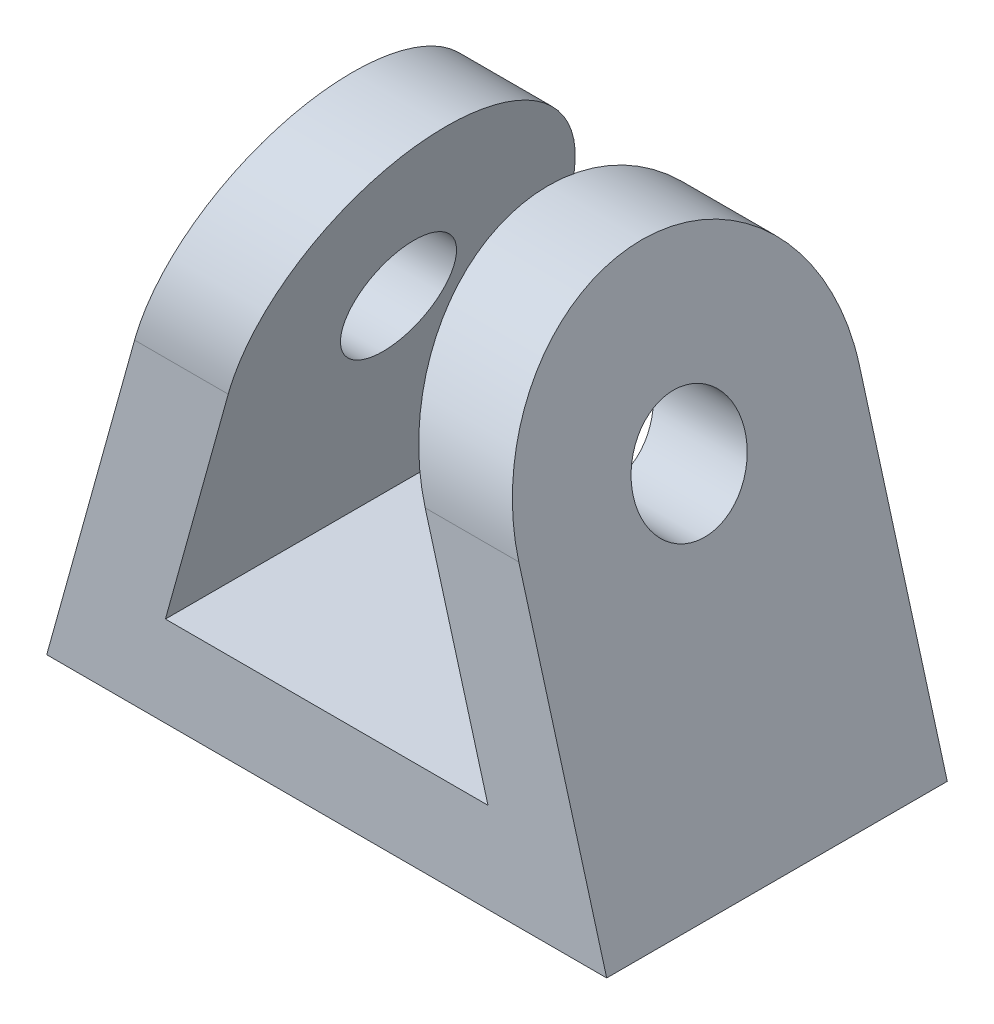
ISO-10303-21;
HEADER;
FILE_DESCRIPTION(('STEP AP214'),'2;1');
FILE_NAME('part.step','',(''),(''),'','','');
FILE_SCHEMA(('AUTOMOTIVE_DESIGN { 1 0 10303 214 1 1 1 1 }'));
ENDSEC;
DATA;
#1=APPLICATION_CONTEXT('core data for automotive mechanical design processes');
#2=APPLICATION_PROTOCOL_DEFINITION('international standard','automotive_design',2000,#1);
#3=PRODUCT_CONTEXT('',#1,'mechanical');
#4=PRODUCT('Part','Part','',(#3));
#5=PRODUCT_RELATED_PRODUCT_CATEGORY('part','',(#4));
#6=PRODUCT_DEFINITION_FORMATION('','',#4);
#7=PRODUCT_DEFINITION_CONTEXT('part definition',#1,'design');
#8=PRODUCT_DEFINITION('design','',#6,#7);
#9=PRODUCT_DEFINITION_SHAPE('','',#8);
#10=(LENGTH_UNIT() NAMED_UNIT(*) SI_UNIT(.MILLI.,.METRE.));
#11=(NAMED_UNIT(*) PLANE_ANGLE_UNIT() SI_UNIT($,.RADIAN.));
#12=(NAMED_UNIT(*) SI_UNIT($,.STERADIAN.) SOLID_ANGLE_UNIT());
#13=UNCERTAINTY_MEASURE_WITH_UNIT(LENGTH_MEASURE(1.E-05),#10,'distance_accuracy_value','');
#14=(GEOMETRIC_REPRESENTATION_CONTEXT(3) GLOBAL_UNCERTAINTY_ASSIGNED_CONTEXT((#13)) GLOBAL_UNIT_ASSIGNED_CONTEXT((#10,
#11,#12)) REPRESENTATION_CONTEXT('',''));
#15=CARTESIAN_POINT('',(0.,0.,0.));
#16=DIRECTION('',(0.,0.,1.));
#17=DIRECTION('',(1.,0.,0.));
#18=AXIS2_PLACEMENT_3D('',#15,#16,#17);
#19=CARTESIAN_POINT('',(5.85609535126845,73.3674893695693,45.974));
#20=DIRECTION('',(-0.963538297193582,-0.267570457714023,0.));
#21=DIRECTION('',(0.267570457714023,-0.963538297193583,0.));
#22=AXIS2_PLACEMENT_3D('',#19,#20,#21);
#23=PLANE('',#22);
#24=CARTESIAN_POINT('',(13.8628764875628,44.5345594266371,0.));
#25=DIRECTION('',(-0.963538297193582,-0.267570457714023,0.));
#26=DIRECTION('',(-0.267570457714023,0.963538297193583,0.));
#27=AXIS2_PLACEMENT_3D('',#24,#25,#26);
#28=ELLIPSE('',#27,8.17309704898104,7.87509201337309);
#29=CARTESIAN_POINT('',(11.6759971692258,52.4096514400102,0.));
#30=VERTEX_POINT('',#29);
#31=EDGE_CURVE('E128',#30,#30,#28,.F.);
#32=ORIENTED_EDGE('',*,*,#31,.T.);
#33=EDGE_LOOP('',(#32));
#34=FACE_BOUND('',#33,.T.);
#35=DIRECTION('',(-0.267570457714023,0.963538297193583,0.));
#36=VECTOR('',#35,1.);
#37=CARTESIAN_POINT('',(5.85609535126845,73.3674893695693,-23.9711510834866));
#38=LINE('',#37,#36);
#39=CARTESIAN_POINT('',(22.7031972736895,12.7,-23.9711510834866));
#40=VERTEX_POINT('',#39);
#41=CARTESIAN_POINT('',(13.8628764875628,44.5345594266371,-23.9711510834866));
#42=VERTEX_POINT('',#41);
#43=EDGE_CURVE('E157',#40,#42,#38,.T.);
#44=ORIENTED_EDGE('',*,*,#43,.F.);
#45=DIRECTION('',(0.,0.,-1.));
#46=VECTOR('',#45,1.);
#47=CARTESIAN_POINT('',(22.7031972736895,12.7,45.974));
#48=LINE('',#47,#46);
#49=CARTESIAN_POINT('',(22.7031972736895,12.7,23.9711510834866));
#50=VERTEX_POINT('',#49);
#51=EDGE_CURVE('E122',#50,#40,#48,.T.);
#52=ORIENTED_EDGE('',*,*,#51,.F.);
#53=DIRECTION('',(0.267570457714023,-0.963538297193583,0.));
#54=VECTOR('',#53,1.);
#55=CARTESIAN_POINT('',(5.85609535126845,73.3674893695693,23.9711510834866));
#56=LINE('',#55,#54);
#57=CARTESIAN_POINT('',(13.8628764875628,44.5345594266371,23.9711510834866));
#58=VERTEX_POINT('',#57);
#59=EDGE_CURVE('E146',#58,#50,#56,.T.);
#60=ORIENTED_EDGE('',*,*,#59,.F.);
#61=CARTESIAN_POINT('',(13.8628764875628,44.5345594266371,0.));
#62=DIRECTION('',(-0.963538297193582,-0.267570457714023,0.));
#63=DIRECTION('',(-0.267570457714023,0.963538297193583,0.));
#64=AXIS2_PLACEMENT_3D('',#61,#62,#63);
#65=ELLIPSE('',#64,24.8782546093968,23.9711510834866);
#66=EDGE_CURVE('E53',#42,#58,#65,.F.);
#67=ORIENTED_EDGE('',*,*,#66,.F.);
#68=EDGE_LOOP('',(#44,#52,#60,#67));
#69=FACE_BOUND('',#68,.T.);
#70=ADVANCED_FACE('F28',(#34,#69),#23,.T.);
#71=CARTESIAN_POINT('',(-22.7031972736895,12.7,45.974));
#72=DIRECTION('',(0.963538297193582,-0.267570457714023,0.));
#73=DIRECTION('',(0.267570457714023,0.963538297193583,0.));
#74=AXIS2_PLACEMENT_3D('',#71,#72,#73);
#75=PLANE('',#74);
#76=CARTESIAN_POINT('',(-13.8628764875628,44.5345594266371,0.));
#77=DIRECTION('',(0.963538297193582,-0.267570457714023,0.));
#78=DIRECTION('',(-0.267570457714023,-0.963538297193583,0.));
#79=AXIS2_PLACEMENT_3D('',#76,#77,#78);
#80=ELLIPSE('',#79,8.17309704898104,7.87509201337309);
#81=CARTESIAN_POINT('',(-16.0497558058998,36.659467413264,0.));
#82=VERTEX_POINT('',#81);
#83=EDGE_CURVE('E126',#82,#82,#80,.F.);
#84=ORIENTED_EDGE('',*,*,#83,.T.);
#85=EDGE_LOOP('',(#84));
#86=FACE_BOUND('',#85,.T.);
#87=DIRECTION('',(-0.267570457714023,-0.963538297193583,0.));
#88=VECTOR('',#87,1.);
#89=CARTESIAN_POINT('',(-22.7031972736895,12.7,-23.9711510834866));
#90=LINE('',#89,#88);
#91=CARTESIAN_POINT('',(-13.8628764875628,44.5345594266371,-23.9711510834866));
#92=VERTEX_POINT('',#91);
#93=CARTESIAN_POINT('',(-22.7031972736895,12.7,-23.9711510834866));
#94=VERTEX_POINT('',#93);
#95=EDGE_CURVE('E32',#92,#94,#90,.T.);
#96=ORIENTED_EDGE('',*,*,#95,.F.);
#97=CARTESIAN_POINT('',(-13.8628764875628,44.5345594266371,0.));
#98=DIRECTION('',(0.963538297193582,-0.267570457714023,0.));
#99=DIRECTION('',(-0.267570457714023,-0.963538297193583,0.));
#100=AXIS2_PLACEMENT_3D('',#97,#98,#99);
#101=ELLIPSE('',#100,24.8782546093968,23.9711510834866);
#102=CARTESIAN_POINT('',(-13.8628764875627,44.5345594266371,23.9711510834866));
#103=VERTEX_POINT('',#102);
#104=EDGE_CURVE('E120',#103,#92,#101,.F.);
#105=ORIENTED_EDGE('',*,*,#104,.F.);
#106=DIRECTION('',(0.267570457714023,0.963538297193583,0.));
#107=VECTOR('',#106,1.);
#108=CARTESIAN_POINT('',(-22.7031972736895,12.7,23.9711510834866));
#109=LINE('',#108,#107);
#110=CARTESIAN_POINT('',(-22.7031972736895,12.7,23.9711510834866));
#111=VERTEX_POINT('',#110);
#112=EDGE_CURVE('E117',#111,#103,#109,.T.);
#113=ORIENTED_EDGE('',*,*,#112,.F.);
#114=DIRECTION('',(0.,0.,-1.));
#115=VECTOR('',#114,1.);
#116=CARTESIAN_POINT('',(-22.7031972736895,12.7,45.974));
#117=LINE('',#116,#115);
#118=EDGE_CURVE('E164',#111,#94,#117,.T.);
#119=ORIENTED_EDGE('',*,*,#118,.T.);
#120=EDGE_LOOP('',(#96,#105,#113,#119));
#121=FACE_BOUND('',#120,.T.);
#122=ADVANCED_FACE('F182',(#86,#121),#75,.T.);
#123=CARTESIAN_POINT('',(22.7031972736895,12.7,45.974));
#124=DIRECTION('',(0.,1.,0.));
#125=DIRECTION('',(-1.,0.,0.));
#126=AXIS2_PLACEMENT_3D('',#123,#124,#125);
#127=PLANE('',#126);
#128=DIRECTION('',(1.,0.,0.));
#129=VECTOR('',#128,1.);
#130=CARTESIAN_POINT('',(22.7031972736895,12.7,-23.9711510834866));
#131=LINE('',#130,#129);
#132=EDGE_CURVE('E155',#94,#40,#131,.T.);
#133=ORIENTED_EDGE('',*,*,#132,.F.);
#134=ORIENTED_EDGE('',*,*,#118,.F.);
#135=DIRECTION('',(-1.,0.,0.));
#136=VECTOR('',#135,1.);
#137=CARTESIAN_POINT('',(22.7031972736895,12.7,23.9711510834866));
#138=LINE('',#137,#136);
#139=EDGE_CURVE('E143',#50,#111,#138,.T.);
#140=ORIENTED_EDGE('',*,*,#139,.F.);
#141=ORIENTED_EDGE('',*,*,#51,.T.);
#142=EDGE_LOOP('',(#133,#134,#140,#141));
#143=FACE_BOUND('',#142,.T.);
#144=ADVANCED_FACE('F169',(#143),#127,.T.);
#145=CARTESIAN_POINT('',(56.642,44.5345594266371,0.));
#146=DIRECTION('',(-1.,0.,0.));
#147=DIRECTION('',(0.,0.,1.));
#148=AXIS2_PLACEMENT_3D('',#145,#146,#147);
#149=CYLINDRICAL_SURFACE('',#148,7.87509201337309);
#150=ORIENTED_EDGE('',*,*,#83,.F.);
#151=EDGE_LOOP('',(#150));
#152=FACE_BOUND('',#151,.T.);
#153=CARTESIAN_POINT('',(-27.0434631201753,44.5345594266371,0.));
#154=DIRECTION('',(0.963538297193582,-0.267570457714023,0.));
#155=DIRECTION('',(-0.267570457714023,-0.963538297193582,0.));
#156=AXIS2_PLACEMENT_3D('',#153,#154,#155);
#157=ELLIPSE('',#156,8.17309704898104,7.87509201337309);
#158=CARTESIAN_POINT('',(-29.2303424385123,36.659467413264,0.));
#159=VERTEX_POINT('',#158);
#160=EDGE_CURVE('E37',#159,#159,#157,.F.);
#161=ORIENTED_EDGE('',*,*,#160,.T.);
#162=EDGE_LOOP('',(#161));
#163=FACE_BOUND('',#162,.T.);
#164=ADVANCED_FACE('F194',(#152,#163),#149,.F.);
#165=CARTESIAN_POINT('',(56.642,0.,23.9711510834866));
#166=DIRECTION('',(0.,0.,-1.));
#167=DIRECTION('',(0.,1.,0.));
#168=AXIS2_PLACEMENT_3D('',#165,#166,#167);
#169=PLANE('',#168);
#170=DIRECTION('',(0.267570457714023,-0.963538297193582,0.));
#171=VECTOR('',#170,1.);
#172=CARTESIAN_POINT('',(15.5099463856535,86.0674893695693,23.9711510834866));
#173=LINE('',#172,#171);
#174=CARTESIAN_POINT('',(27.0434631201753,44.5345594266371,23.9711510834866));
#175=VERTEX_POINT('',#174);
#176=CARTESIAN_POINT('',(39.4105195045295,0.,23.9711510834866));
#177=VERTEX_POINT('',#176);
#178=EDGE_CURVE('E98',#175,#177,#173,.T.);
#179=ORIENTED_EDGE('',*,*,#178,.F.);
#180=DIRECTION('',(-1.,0.,0.));
#181=VECTOR('',#180,1.);
#182=CARTESIAN_POINT('',(56.642,44.5345594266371,23.9711510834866));
#183=LINE('',#182,#181);
#184=EDGE_CURVE('E179',#175,#58,#183,.T.);
#185=ORIENTED_EDGE('',*,*,#184,.T.);
#186=ORIENTED_EDGE('',*,*,#59,.T.);
#187=ORIENTED_EDGE('',*,*,#139,.T.);
#188=ORIENTED_EDGE('',*,*,#112,.T.);
#189=CARTESIAN_POINT('',(-27.0434631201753,44.5345594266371,23.9711510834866));
#190=VERTEX_POINT('',#189);
#191=EDGE_CURVE('E45',#103,#190,#183,.T.);
#192=ORIENTED_EDGE('',*,*,#191,.T.);
#193=DIRECTION('',(0.267570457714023,0.963538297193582,0.));
#194=VECTOR('',#193,1.);
#195=CARTESIAN_POINT('',(-39.4105195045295,0.,23.9711510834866));
#196=LINE('',#195,#194);
#197=CARTESIAN_POINT('',(-39.4105195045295,0.,23.9711510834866));
#198=VERTEX_POINT('',#197);
#199=EDGE_CURVE('E101',#198,#190,#196,.T.);
#200=ORIENTED_EDGE('',*,*,#199,.F.);
#201=DIRECTION('',(-1.,0.,0.));
#202=VECTOR('',#201,1.);
#203=CARTESIAN_POINT('',(56.642,0.,23.9711510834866));
#204=LINE('',#203,#202);
#205=EDGE_CURVE('E94',#177,#198,#204,.T.);
#206=ORIENTED_EDGE('',*,*,#205,.F.);
#207=EDGE_LOOP('',(#179,#185,#186,#187,#188,#192,#200,#206));
#208=FACE_BOUND('',#207,.T.);
#209=ADVANCED_FACE('F96',(#208),#169,.F.);
#210=CARTESIAN_POINT('',(56.642,44.5345594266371,0.));
#211=DIRECTION('',(-1.,0.,0.));
#212=DIRECTION('',(0.,0.,1.));
#213=AXIS2_PLACEMENT_3D('',#210,#211,#212);
#214=CYLINDRICAL_SURFACE('',#213,23.9711510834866);
#215=CARTESIAN_POINT('',(-27.0434631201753,44.5345594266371,0.));
#216=DIRECTION('',(0.963538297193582,-0.267570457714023,0.));
#217=DIRECTION('',(-0.267570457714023,-0.963538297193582,0.));
#218=AXIS2_PLACEMENT_3D('',#215,#216,#217);
#219=ELLIPSE('',#218,24.8782546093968,23.9711510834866);
#220=CARTESIAN_POINT('',(-27.0434631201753,44.5345594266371,-23.9711510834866));
#221=VERTEX_POINT('',#220);
#222=EDGE_CURVE('E151',#190,#221,#219,.F.);
#223=ORIENTED_EDGE('',*,*,#222,.F.);
#224=ORIENTED_EDGE('',*,*,#191,.F.);
#225=ORIENTED_EDGE('',*,*,#104,.T.);
#226=DIRECTION('',(-1.,0.,0.));
#227=VECTOR('',#226,1.);
#228=CARTESIAN_POINT('',(56.642,44.5345594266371,-23.9711510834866));
#229=LINE('',#228,#227);
#230=EDGE_CURVE('E177',#92,#221,#229,.T.);
#231=ORIENTED_EDGE('',*,*,#230,.T.);
#232=EDGE_LOOP('',(#223,#224,#225,#231));
#233=FACE_BOUND('',#232,.T.);
#234=ADVANCED_FACE('F211',(#233),#214,.T.);
#235=CARTESIAN_POINT('',(56.642,44.5345594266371,-23.9711510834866));
#236=DIRECTION('',(0.,0.,1.));
#237=DIRECTION('',(0.,-1.,0.));
#238=AXIS2_PLACEMENT_3D('',#235,#236,#237);
#239=PLANE('',#238);
#240=DIRECTION('',(-0.267570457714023,0.963538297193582,0.));
#241=VECTOR('',#240,1.);
#242=CARTESIAN_POINT('',(15.5099463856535,86.0674893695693,-23.9711510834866));
#243=LINE('',#242,#241);
#244=CARTESIAN_POINT('',(39.4105195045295,0.,-23.9711510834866));
#245=VERTEX_POINT('',#244);
#246=CARTESIAN_POINT('',(27.0434631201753,44.5345594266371,-23.9711510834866));
#247=VERTEX_POINT('',#246);
#248=EDGE_CURVE('E162',#245,#247,#243,.T.);
#249=ORIENTED_EDGE('',*,*,#248,.F.);
#250=DIRECTION('',(-1.,0.,0.));
#251=VECTOR('',#250,1.);
#252=CARTESIAN_POINT('',(56.642,0.,-23.9711510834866));
#253=LINE('',#252,#251);
#254=CARTESIAN_POINT('',(-39.4105195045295,0.,-23.9711510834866));
#255=VERTEX_POINT('',#254);
#256=EDGE_CURVE('E116',#245,#255,#253,.T.);
#257=ORIENTED_EDGE('',*,*,#256,.T.);
#258=DIRECTION('',(-0.267570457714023,-0.963538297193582,0.));
#259=VECTOR('',#258,1.);
#260=CARTESIAN_POINT('',(-39.4105195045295,0.,-23.9711510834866));
#261=LINE('',#260,#259);
#262=EDGE_CURVE('E159',#221,#255,#261,.T.);
#263=ORIENTED_EDGE('',*,*,#262,.F.);
#264=ORIENTED_EDGE('',*,*,#230,.F.);
#265=ORIENTED_EDGE('',*,*,#95,.T.);
#266=ORIENTED_EDGE('',*,*,#132,.T.);
#267=ORIENTED_EDGE('',*,*,#43,.T.);
#268=EDGE_CURVE('E174',#247,#42,#229,.T.);
#269=ORIENTED_EDGE('',*,*,#268,.F.);
#270=EDGE_LOOP('',(#249,#257,#263,#264,#265,#266,#267,#269));
#271=FACE_BOUND('',#270,.T.);
#272=ADVANCED_FACE('F171',(#271),#239,.F.);
#273=CARTESIAN_POINT('',(27.0434631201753,44.5345594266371,0.));
#274=DIRECTION('',(-0.963538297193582,-0.267570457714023,0.));
#275=DIRECTION('',(-0.267570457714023,0.963538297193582,0.));
#276=AXIS2_PLACEMENT_3D('',#273,#274,#275);
#277=ELLIPSE('',#276,24.8782546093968,23.9711510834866);
#278=EDGE_CURVE('E113',#247,#175,#277,.F.);
#279=ORIENTED_EDGE('',*,*,#278,.F.);
#280=ORIENTED_EDGE('',*,*,#268,.T.);
#281=ORIENTED_EDGE('',*,*,#66,.T.);
#282=ORIENTED_EDGE('',*,*,#184,.F.);
#283=EDGE_LOOP('',(#279,#280,#281,#282));
#284=FACE_BOUND('',#283,.T.);
#285=ADVANCED_FACE('F176',(#284),#214,.T.);
#286=ORIENTED_EDGE('',*,*,#31,.F.);
#287=EDGE_LOOP('',(#286));
#288=FACE_BOUND('',#287,.T.);
#289=CARTESIAN_POINT('',(27.0434631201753,44.5345594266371,0.));
#290=DIRECTION('',(-0.963538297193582,-0.267570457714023,0.));
#291=DIRECTION('',(-0.267570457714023,0.963538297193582,0.));
#292=AXIS2_PLACEMENT_3D('',#289,#290,#291);
#293=ELLIPSE('',#292,8.17309704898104,7.87509201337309);
#294=CARTESIAN_POINT('',(24.8565838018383,52.4096514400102,0.));
#295=VERTEX_POINT('',#294);
#296=EDGE_CURVE('E11',#295,#295,#293,.F.);
#297=ORIENTED_EDGE('',*,*,#296,.T.);
#298=EDGE_LOOP('',(#297));
#299=FACE_BOUND('',#298,.T.);
#300=ADVANCED_FACE('F202',(#288,#299),#149,.F.);
#301=CARTESIAN_POINT('',(39.4105195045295,0.,45.974));
#302=DIRECTION('',(0.,1.,0.));
#303=DIRECTION('',(0.,0.,1.));
#304=AXIS2_PLACEMENT_3D('',#301,#302,#303);
#305=PLANE('',#304);
#306=DIRECTION('',(0.,0.,-1.));
#307=VECTOR('',#306,1.);
#308=CARTESIAN_POINT('',(-39.4105195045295,0.,45.974));
#309=LINE('',#308,#307);
#310=EDGE_CURVE('E118',#198,#255,#309,.T.);
#311=ORIENTED_EDGE('',*,*,#310,.T.);
#312=ORIENTED_EDGE('',*,*,#256,.F.);
#313=DIRECTION('',(0.,0.,-1.));
#314=VECTOR('',#313,1.);
#315=CARTESIAN_POINT('',(39.4105195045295,0.,45.974));
#316=LINE('',#315,#314);
#317=EDGE_CURVE('E112',#177,#245,#316,.T.);
#318=ORIENTED_EDGE('',*,*,#317,.F.);
#319=ORIENTED_EDGE('',*,*,#205,.T.);
#320=EDGE_LOOP('',(#311,#312,#318,#319));
#321=FACE_BOUND('',#320,.T.);
#322=ADVANCED_FACE('F30',(#321),#305,.F.);
#323=CARTESIAN_POINT('',(15.5099463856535,86.0674893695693,45.974));
#324=DIRECTION('',(-0.963538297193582,-0.267570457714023,0.));
#325=DIRECTION('',(0.267570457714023,-0.963538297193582,0.));
#326=AXIS2_PLACEMENT_3D('',#323,#324,#325);
#327=PLANE('',#326);
#328=ORIENTED_EDGE('',*,*,#296,.F.);
#329=EDGE_LOOP('',(#328));
#330=FACE_BOUND('',#329,.T.);
#331=ORIENTED_EDGE('',*,*,#317,.T.);
#332=ORIENTED_EDGE('',*,*,#248,.T.);
#333=ORIENTED_EDGE('',*,*,#278,.T.);
#334=ORIENTED_EDGE('',*,*,#178,.T.);
#335=EDGE_LOOP('',(#331,#332,#333,#334));
#336=FACE_BOUND('',#335,.T.);
#337=ADVANCED_FACE('F110',(#330,#336),#327,.F.);
#338=CARTESIAN_POINT('',(-39.4105195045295,0.,45.974));
#339=DIRECTION('',(0.963538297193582,-0.267570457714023,0.));
#340=DIRECTION('',(0.267570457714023,0.963538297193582,0.));
#341=AXIS2_PLACEMENT_3D('',#338,#339,#340);
#342=PLANE('',#341);
#343=ORIENTED_EDGE('',*,*,#160,.F.);
#344=EDGE_LOOP('',(#343));
#345=FACE_BOUND('',#344,.T.);
#346=ORIENTED_EDGE('',*,*,#222,.T.);
#347=ORIENTED_EDGE('',*,*,#262,.T.);
#348=ORIENTED_EDGE('',*,*,#310,.F.);
#349=ORIENTED_EDGE('',*,*,#199,.T.);
#350=EDGE_LOOP('',(#346,#347,#348,#349));
#351=FACE_BOUND('',#350,.T.);
#352=ADVANCED_FACE('F195',(#345,#351),#342,.F.);
#353=CLOSED_SHELL('',(#70,#122,#144,#164,#209,#234,#272,#285,#300,#322,#337,#352));
#354=MANIFOLD_SOLID_BREP('B2',#353);
#355=ADVANCED_BREP_SHAPE_REPRESENTATION('',(#18,#354),#14);
#356=SHAPE_DEFINITION_REPRESENTATION(#9,#355);
ENDSEC;
END-ISO-10303-21;
